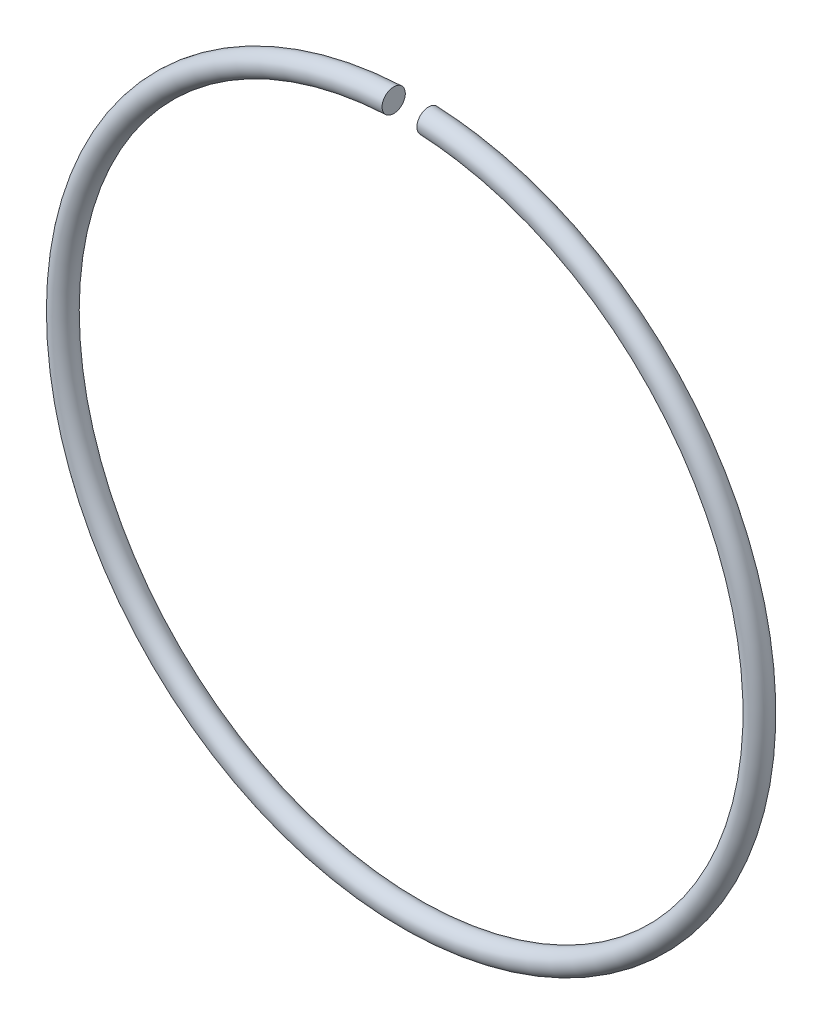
ISO-10303-21;
HEADER;
FILE_DESCRIPTION(('STEP AP214'),'2;1');
FILE_NAME('part.step','',(''),(''),'','','');
FILE_SCHEMA(('AUTOMOTIVE_DESIGN { 1 0 10303 214 1 1 1 1 }'));
ENDSEC;
DATA;
#1=APPLICATION_CONTEXT('core data for automotive mechanical design processes');
#2=APPLICATION_PROTOCOL_DEFINITION('international standard','automotive_design',2000,#1);
#3=PRODUCT_CONTEXT('',#1,'mechanical');
#4=PRODUCT('Part','Part','',(#3));
#5=PRODUCT_RELATED_PRODUCT_CATEGORY('part','',(#4));
#6=PRODUCT_DEFINITION_FORMATION('','',#4);
#7=PRODUCT_DEFINITION_CONTEXT('part definition',#1,'design');
#8=PRODUCT_DEFINITION('design','',#6,#7);
#9=PRODUCT_DEFINITION_SHAPE('','',#8);
#10=(LENGTH_UNIT() NAMED_UNIT(*) SI_UNIT(.MILLI.,.METRE.));
#11=(NAMED_UNIT(*) PLANE_ANGLE_UNIT() SI_UNIT($,.RADIAN.));
#12=(NAMED_UNIT(*) SI_UNIT($,.STERADIAN.) SOLID_ANGLE_UNIT());
#13=UNCERTAINTY_MEASURE_WITH_UNIT(LENGTH_MEASURE(1.E-05),#10,'distance_accuracy_value','');
#14=(GEOMETRIC_REPRESENTATION_CONTEXT(3) GLOBAL_UNCERTAINTY_ASSIGNED_CONTEXT((#13)) GLOBAL_UNIT_ASSIGNED_CONTEXT((#10,
#11,#12)) REPRESENTATION_CONTEXT('',''));
#15=CARTESIAN_POINT('',(0.,0.,0.));
#16=DIRECTION('',(0.,0.,1.));
#17=DIRECTION('',(1.,0.,0.));
#18=AXIS2_PLACEMENT_3D('',#15,#16,#17);
#19=CARTESIAN_POINT('',(0.,0.,0.));
#20=DIRECTION('',(0.,0.,1.));
#21=DIRECTION('',(1.,0.,0.));
#22=AXIS2_PLACEMENT_3D('',#19,#20,#21);
#23=TOROIDAL_SURFACE('',#22,15.,0.5);
#24=CARTESIAN_POINT('',(0.75,14.5260586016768,-0.208196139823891));
#25=CARTESIAN_POINT('',(0.75,14.5377707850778,-0.233732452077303));
#26=CARTESIAN_POINT('',(0.75,14.5516501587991,-0.258297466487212));
#27=CARTESIAN_POINT('',(0.75,14.58334953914,-0.304767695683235));
#28=CARTESIAN_POINT('',(0.75,14.6011743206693,-0.326669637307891));
#29=CARTESIAN_POINT('',(0.750000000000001,14.6402396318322,-0.36716071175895));
#30=CARTESIAN_POINT('',(0.750000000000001,14.6614783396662,-0.385751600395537));
#31=CARTESIAN_POINT('',(0.750000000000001,14.7067671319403,-0.419102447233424));
#32=CARTESIAN_POINT('',(0.750000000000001,14.7308165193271,-0.433863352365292));
#33=CARTESIAN_POINT('',(0.750000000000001,14.7810752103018,-0.459158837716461));
#34=CARTESIAN_POINT('',(0.750000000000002,14.807286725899,-0.469689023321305));
#35=CARTESIAN_POINT('',(0.750000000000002,14.8611055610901,-0.486204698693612));
#36=CARTESIAN_POINT('',(0.750000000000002,14.888712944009,-0.49218998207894));
#37=CARTESIAN_POINT('',(0.750000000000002,14.9445675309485,-0.499450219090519));
#38=CARTESIAN_POINT('',(0.750000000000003,14.9728153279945,-0.500720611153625));
#39=CARTESIAN_POINT('',(0.750000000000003,15.0291234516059,-0.498502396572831));
#40=CARTESIAN_POINT('',(0.750000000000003,15.0571837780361,-0.495013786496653));
#41=CARTESIAN_POINT('',(0.750000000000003,15.1123281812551,-0.48337404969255));
#42=CARTESIAN_POINT('',(0.750000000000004,15.1394119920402,-0.475221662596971));
#43=CARTESIAN_POINT('',(0.750000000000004,15.1918253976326,-0.454483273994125));
#44=CARTESIAN_POINT('',(0.750000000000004,15.2171549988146,-0.441897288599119));
#45=CARTESIAN_POINT('',(0.750000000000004,15.2653260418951,-0.412655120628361));
#46=CARTESIAN_POINT('',(0.750000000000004,15.2881687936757,-0.396001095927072));
#47=CARTESIAN_POINT('',(0.750000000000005,15.3307303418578,-0.359090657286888));
#48=CARTESIAN_POINT('',(0.750000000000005,15.3504491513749,-0.338834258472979));
#49=CARTESIAN_POINT('',(0.750000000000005,15.3861803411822,-0.295317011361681));
#50=CARTESIAN_POINT('',(0.750000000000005,15.4021966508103,-0.272059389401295));
#51=CARTESIAN_POINT('',(0.750000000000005,15.4300920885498,-0.223182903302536));
#52=CARTESIAN_POINT('',(0.750000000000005,15.4419712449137,-0.197564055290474));
#53=CARTESIAN_POINT('',(0.750000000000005,15.4612413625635,-0.144723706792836));
#54=CARTESIAN_POINT('',(0.750000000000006,15.468637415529,-0.11750406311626));
#55=CARTESIAN_POINT('',(0.750000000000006,15.4787509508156,-0.0622090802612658));
#56=CARTESIAN_POINT('',(0.750000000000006,15.4814684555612,-0.0341337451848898));
#57=CARTESIAN_POINT('',(0.750000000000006,15.4821468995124,0.0220533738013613));
#58=CARTESIAN_POINT('',(0.750000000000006,15.4801113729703,0.0501651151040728));
#59=CARTESIAN_POINT('',(0.750000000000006,15.4713493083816,0.105647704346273));
#60=CARTESIAN_POINT('',(0.750000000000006,15.4646227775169,0.133018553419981));
#61=CARTESIAN_POINT('',(0.750000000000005,15.4466713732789,0.186241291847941));
#62=CARTESIAN_POINT('',(0.750000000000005,15.4354467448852,0.212093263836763));
#63=CARTESIAN_POINT('',(0.750000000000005,15.4088193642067,0.261547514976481));
#64=CARTESIAN_POINT('',(0.750000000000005,15.393416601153,0.285149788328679));
#65=CARTESIAN_POINT('',(0.750000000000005,15.3588601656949,0.329451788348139));
#66=CARTESIAN_POINT('',(0.750000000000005,15.3397040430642,0.350149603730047));
#67=CARTESIAN_POINT('',(0.750000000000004,15.2981922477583,0.388039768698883));
#68=CARTESIAN_POINT('',(0.750000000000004,15.2758365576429,0.405232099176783));
#69=CARTESIAN_POINT('',(0.750000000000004,15.2285339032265,0.435643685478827));
#70=CARTESIAN_POINT('',(0.750000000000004,15.2035841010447,0.448858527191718));
#71=CARTESIAN_POINT('',(0.750000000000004,15.1518218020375,0.470917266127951));
#72=CARTESIAN_POINT('',(0.750000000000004,15.1250092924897,0.47976113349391));
#73=CARTESIAN_POINT('',(0.750000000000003,15.0702508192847,0.4928365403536));
#74=CARTESIAN_POINT('',(0.750000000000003,15.0423036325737,0.497062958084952));
#75=CARTESIAN_POINT('',(0.750000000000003,14.9860963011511,0.500767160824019));
#76=CARTESIAN_POINT('',(0.750000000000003,14.957836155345,0.500244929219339));
#77=CARTESIAN_POINT('',(0.750000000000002,14.9017861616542,0.494464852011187));
#78=CARTESIAN_POINT('',(0.750000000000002,14.8739966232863,0.489204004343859));
#79=CARTESIAN_POINT('',(0.750000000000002,14.8196952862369,0.474090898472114));
#80=CARTESIAN_POINT('',(0.750000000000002,14.7931834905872,0.46423862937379));
#81=CARTESIAN_POINT('',(0.750000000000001,14.7421951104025,0.440222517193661));
#82=CARTESIAN_POINT('',(0.750000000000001,14.7177182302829,0.426059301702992));
#83=CARTESIAN_POINT('',(0.750000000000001,14.6714924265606,0.393821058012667));
#84=CARTESIAN_POINT('',(0.750000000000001,14.6497434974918,0.37574603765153));
#85=CARTESIAN_POINT('',(0.750000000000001,14.609612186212,0.336213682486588));
#86=CARTESIAN_POINT('',(0.75,14.5912268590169,0.314759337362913));
#87=CARTESIAN_POINT('',(0.75,14.5583252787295,0.269065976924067));
#88=CARTESIAN_POINT('',(0.75,14.5438088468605,0.244827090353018));
#89=CARTESIAN_POINT('',(0.75,14.5190769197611,0.194288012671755));
#90=CARTESIAN_POINT('',(0.75,14.508855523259,0.167990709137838));
#91=CARTESIAN_POINT('',(0.75,14.4929757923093,0.114044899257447));
#92=CARTESIAN_POINT('',(0.75,14.4873185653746,0.0863960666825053));
#93=CARTESIAN_POINT('',(0.75,14.4807344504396,0.0305599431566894));
#94=CARTESIAN_POINT('',(0.75,14.4798047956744,0.00237297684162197));
#95=CARTESIAN_POINT('',(0.75,14.4826976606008,-0.0537325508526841));
#96=CARTESIAN_POINT('',(0.75,14.4865144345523,-0.0816513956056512));
#97=CARTESIAN_POINT('',(0.75,14.4964549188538,-0.126089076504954));
#98=CARTESIAN_POINT('',(0.75,14.5011660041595,-0.142936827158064));
#99=CARTESIAN_POINT('',(0.75,14.5123246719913,-0.176047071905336));
#100=CARTESIAN_POINT('',(0.75,14.5187722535,-0.192309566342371));
#101=CARTESIAN_POINT('',(0.75,14.5260586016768,-0.208196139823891));
#102=B_SPLINE_CURVE_WITH_KNOTS('',3,(#24,#25,#26,#27,#28,#29,#30,#31,#32,#33,#34,#35,#36,#37,
#38,#39,#40,#41,#42,#43,#44,#45,#46,#47,#48,#49,#50,#51,#52,#53,#54,#55,#56,#57,#58,#59,#60,#61,
#62,#63,#64,#65,#66,#67,#68,#69,#70,#71,#72,#73,#74,#75,#76,#77,#78,#79,#80,#81,#82,#83,#84,#85,
#86,#87,#88,#89,#90,#91,#92,#93,#94,#95,#96,#97,#98,#99,#100,#101),.UNSPECIFIED.,.T.,.F.,(4,2,2,
2,2,2,2,2,2,2,2,2,2,2,2,2,2,2,2,2,2,2,2,2,2,2,2,2,2,2,2,2,2,2,2,2,2,2,4),(0.,0.0842184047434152,
0.168539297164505,0.252815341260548,0.337070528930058,0.421413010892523,0.505759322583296,
0.590187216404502,0.67461517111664,0.759065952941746,0.843516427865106,0.927922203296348,
1.01232762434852,1.09664305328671,1.18095790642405,1.26517681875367,1.34939532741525,
1.43355123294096,1.51770700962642,1.60185820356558,1.68600961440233,1.77021614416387,
1.85442313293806,1.93872323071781,2.02302390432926,2.10741799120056,2.19181237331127,
2.27626025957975,2.36070834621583,2.4451441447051,2.5295797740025,2.6139411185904,
2.69829856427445,2.78253972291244,2.86680131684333,2.95101359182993,3.0351240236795,
3.08751775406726,3.1399114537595),.UNSPECIFIED.);
#103=CARTESIAN_POINT('',(0.75,14.5260586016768,-0.208196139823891));
#104=VERTEX_POINT('',#103);
#105=EDGE_CURVE('E359',#104,#104,#102,.T.);
#106=ORIENTED_EDGE('',*,*,#105,.T.);
#107=EDGE_LOOP('',(#106));
#108=FACE_BOUND('',#107,.T.);
#109=CARTESIAN_POINT('',(-0.750000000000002,14.5260586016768,-0.208196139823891));
#110=CARTESIAN_POINT('',(-0.750000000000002,14.5143655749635,-0.182695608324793));
#111=CARTESIAN_POINT('',(-0.750000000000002,14.5048165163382,-0.156189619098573));
#112=CARTESIAN_POINT('',(-0.750000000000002,14.4902964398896,-0.101928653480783));
#113=CARTESIAN_POINT('',(-0.750000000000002,14.4853308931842,-0.0741722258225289));
#114=CARTESIAN_POINT('',(-0.750000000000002,14.4801339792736,-0.0182298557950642));
#115=CARTESIAN_POINT('',(-0.750000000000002,14.4799004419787,0.00995588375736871));
#116=CARTESIAN_POINT('',(-0.750000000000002,14.4841700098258,0.065958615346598));
#117=CARTESIAN_POINT('',(-0.750000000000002,14.4886719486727,0.0937756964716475));
#118=CARTESIAN_POINT('',(-0.750000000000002,14.5022808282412,0.148257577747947));
#119=CARTESIAN_POINT('',(-0.750000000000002,14.5113874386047,0.174922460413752));
#120=CARTESIAN_POINT('',(-0.750000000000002,14.533945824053,0.226347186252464));
#121=CARTESIAN_POINT('',(-0.750000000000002,14.5473977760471,0.251106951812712));
#122=CARTESIAN_POINT('',(-0.750000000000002,14.5782721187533,0.298033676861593));
#123=CARTESIAN_POINT('',(-0.750000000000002,14.5956968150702,0.320199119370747));
#124=CARTESIAN_POINT('',(-0.750000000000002,14.6340160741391,0.361294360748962));
#125=CARTESIAN_POINT('',(-0.750000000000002,14.6549106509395,0.380224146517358));
#126=CARTESIAN_POINT('',(-0.750000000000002,14.6996030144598,0.414335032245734));
#127=CARTESIAN_POINT('',(-0.750000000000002,14.7234042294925,0.429511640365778));
#128=CARTESIAN_POINT('',(-0.750000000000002,14.773214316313,0.455659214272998));
#129=CARTESIAN_POINT('',(-0.750000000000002,14.7992231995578,0.466630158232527));
#130=CARTESIAN_POINT('',(-0.750000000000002,14.8527444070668,0.484068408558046));
#131=CARTESIAN_POINT('',(-0.750000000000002,14.8802585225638,0.490530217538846));
#132=CARTESIAN_POINT('',(-0.750000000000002,14.9359809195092,0.498746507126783));
#133=CARTESIAN_POINT('',(-0.750000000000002,14.9641892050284,0.500500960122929));
#134=CARTESIAN_POINT('',(-0.750000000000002,15.0205200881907,0.499252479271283));
#135=CARTESIAN_POINT('',(-0.750000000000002,15.0486426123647,0.496246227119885));
#136=CARTESIAN_POINT('',(-0.750000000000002,15.1039837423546,0.485554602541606));
#137=CARTESIAN_POINT('',(-0.750000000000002,15.1312023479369,0.477869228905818));
#138=CARTESIAN_POINT('',(-0.750000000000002,15.1839594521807,0.458036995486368));
#139=CARTESIAN_POINT('',(-0.750000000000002,15.2094981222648,0.445890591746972));
#140=CARTESIAN_POINT('',(-0.750000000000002,15.2581714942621,0.417479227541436));
#141=CARTESIAN_POINT('',(-0.750000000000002,15.2813062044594,0.401214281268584));
#142=CARTESIAN_POINT('',(-0.750000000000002,15.3244941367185,0.365041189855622));
#143=CARTESIAN_POINT('',(-0.750000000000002,15.3445498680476,0.345136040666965));
#144=CARTESIAN_POINT('',(-0.750000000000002,15.381030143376,0.302237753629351));
#145=CARTESIAN_POINT('',(-0.750000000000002,15.3974547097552,0.279244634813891));
#146=CARTESIAN_POINT('',(-0.750000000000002,15.4261861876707,0.230851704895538));
#147=CARTESIAN_POINT('',(-0.750000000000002,15.4384978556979,0.205454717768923));
#148=CARTESIAN_POINT('',(-0.750000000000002,15.4586777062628,0.152952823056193));
#149=CARTESIAN_POINT('',(-0.750000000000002,15.4665459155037,0.125847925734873));
#150=CARTESIAN_POINT('',(-0.750000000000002,15.4776079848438,0.0707290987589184));
#151=CARTESIAN_POINT('',(-0.750000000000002,15.4808065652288,0.0427161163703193));
#152=CARTESIAN_POINT('',(-0.750000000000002,15.482452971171,-0.0134490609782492));
#153=CARTESIAN_POINT('',(-0.750000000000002,15.4809008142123,-0.0416012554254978));
#154=CARTESIAN_POINT('',(-0.750000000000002,15.4730919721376,-0.0972322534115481));
#155=CARTESIAN_POINT('',(-0.750000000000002,15.4668374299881,-0.124711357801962));
#156=CARTESIAN_POINT('',(-0.750000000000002,15.4498050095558,-0.178229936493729));
#157=CARTESIAN_POINT('',(-0.750000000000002,15.4390271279,-0.204269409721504));
#158=CARTESIAN_POINT('',(-0.750000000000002,15.4132518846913,-0.254177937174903));
#159=CARTESIAN_POINT('',(-0.750000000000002,15.3982533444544,-0.278046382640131));
#160=CARTESIAN_POINT('',(-0.750000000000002,15.3644653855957,-0.322929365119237));
#161=CARTESIAN_POINT('',(-0.750000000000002,15.345675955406,-0.343943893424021));
#162=CARTESIAN_POINT('',(-0.750000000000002,15.3048218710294,-0.382543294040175));
#163=CARTESIAN_POINT('',(-0.750000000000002,15.2827542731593,-0.400125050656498));
#164=CARTESIAN_POINT('',(-0.750000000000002,15.2359834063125,-0.431339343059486));
#165=CARTESIAN_POINT('',(-0.750000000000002,15.2112801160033,-0.444971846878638));
#166=CARTESIAN_POINT('',(-0.750000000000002,15.1599082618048,-0.467917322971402));
#167=CARTESIAN_POINT('',(-0.750000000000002,15.1332374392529,-0.477225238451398));
#168=CARTESIAN_POINT('',(-0.750000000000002,15.0787124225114,-0.491236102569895));
#169=CARTESIAN_POINT('',(-0.750000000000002,15.0508582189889,-0.49593901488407));
#170=CARTESIAN_POINT('',(-0.750000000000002,14.9947284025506,-0.500609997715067));
#171=CARTESIAN_POINT('',(-0.750000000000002,14.9664524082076,-0.500573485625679));
#172=CARTESIAN_POINT('',(-0.750000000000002,14.9103086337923,-0.495755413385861));
#173=CARTESIAN_POINT('',(-0.750000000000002,14.8824408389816,-0.490974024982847));
#174=CARTESIAN_POINT('',(-0.750000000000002,14.8278977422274,-0.476800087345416));
#175=CARTESIAN_POINT('',(-0.750000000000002,14.8012226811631,-0.467406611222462));
#176=CARTESIAN_POINT('',(-0.750000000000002,14.7498222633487,-0.444269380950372));
#177=CARTESIAN_POINT('',(-0.750000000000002,14.7250973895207,-0.430524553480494));
#178=CARTESIAN_POINT('',(-0.750000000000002,14.6783116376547,-0.399077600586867));
#179=CARTESIAN_POINT('',(-0.750000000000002,14.6562506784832,-0.381375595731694));
#180=CARTESIAN_POINT('',(-0.750000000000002,14.6154395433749,-0.342527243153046));
#181=CARTESIAN_POINT('',(-0.750000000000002,14.5966853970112,-0.321385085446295));
#182=CARTESIAN_POINT('',(-0.750000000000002,14.5693200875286,-0.284727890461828));
#183=CARTESIAN_POINT('',(-0.750000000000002,14.5595402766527,-0.270069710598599));
#184=CARTESIAN_POINT('',(-0.750000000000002,14.5415784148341,-0.239805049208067));
#185=CARTESIAN_POINT('',(-0.750000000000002,14.5333963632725,-0.224198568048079));
#186=CARTESIAN_POINT('',(-0.750000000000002,14.5260586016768,-0.208196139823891));
#187=B_SPLINE_CURVE_WITH_KNOTS('',3,(#109,#110,#111,#112,#113,#114,#115,#116,#117,#118,#119,
#120,#121,#122,#123,#124,#125,#126,#127,#128,#129,#130,#131,#132,#133,#134,#135,#136,#137,#138,
#139,#140,#141,#142,#143,#144,#145,#146,#147,#148,#149,#150,#151,#152,#153,#154,#155,#156,#157,
#158,#159,#160,#161,#162,#163,#164,#165,#166,#167,#168,#169,#170,#171,#172,#173,#174,#175,#176,
#177,#178,#179,#180,#181,#182,#183,#184,#185,#186),.UNSPECIFIED.,.T.,.F.,(4,2,2,2,2,2,2,2,2,2,2,
2,2,2,2,2,2,2,2,2,2,2,2,2,2,2,2,2,2,2,2,2,2,2,2,2,2,2,4),(0.,0.0840965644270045,
0.168293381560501,0.252451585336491,0.33658906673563,0.420720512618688,0.504855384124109,
0.589039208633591,0.673223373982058,0.757507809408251,0.841792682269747,0.926180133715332,
1.01056808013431,1.09501487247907,1.17946168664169,1.26389987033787,1.34833776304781,
1.43270647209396,1.51707466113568,1.60134493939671,1.68561471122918,1.76979923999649,
1.85398345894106,1.93812933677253,2.02227527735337,2.10644474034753,2.19061446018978,
2.27486022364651,2.35910666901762,2.44345137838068,2.52779675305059,2.61222368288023,
2.69664755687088,2.78108840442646,2.86555009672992,2.95000921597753,3.03436622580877,
3.08713962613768,3.13991300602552),.UNSPECIFIED.);
#188=CARTESIAN_POINT('',(-0.750000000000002,14.5260586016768,-0.208196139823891));
#189=VERTEX_POINT('',#188);
#190=EDGE_CURVE('E10',#189,#189,#187,.T.);
#191=ORIENTED_EDGE('',*,*,#190,.T.);
#192=EDGE_LOOP('',(#191));
#193=FACE_BOUND('',#192,.T.);
#194=ADVANCED_FACE('F349',(#108,#193),#23,.T.);
#195=CARTESIAN_POINT('',(0.750000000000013,16.8121693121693,-0.5));
#196=DIRECTION('',(1.,0.,0.));
#197=DIRECTION('',(0.,1.,0.));
#198=AXIS2_PLACEMENT_3D('',#195,#196,#197);
#199=PLANE('',#198);
#200=ORIENTED_EDGE('',*,*,#105,.F.);
#201=EDGE_LOOP('',(#200));
#202=FACE_BOUND('',#201,.T.);
#203=ADVANCED_FACE('F367',(#202),#199,.F.);
#204=CARTESIAN_POINT('',(-0.750000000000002,14.1836734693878,-0.5));
#205=DIRECTION('',(-1.,0.,0.));
#206=DIRECTION('',(0.,0.,1.));
#207=AXIS2_PLACEMENT_3D('',#204,#205,#206);
#208=PLANE('',#207);
#209=ORIENTED_EDGE('',*,*,#190,.F.);
#210=EDGE_LOOP('',(#209));
#211=FACE_BOUND('',#210,.T.);
#212=ADVANCED_FACE('F370',(#211),#208,.F.);
#213=CLOSED_SHELL('',(#194,#203,#212));
#214=MANIFOLD_SOLID_BREP('B2',#213);
#215=ADVANCED_BREP_SHAPE_REPRESENTATION('',(#18,#214),#14);
#216=SHAPE_DEFINITION_REPRESENTATION(#9,#215);
ENDSEC;
END-ISO-10303-21;
